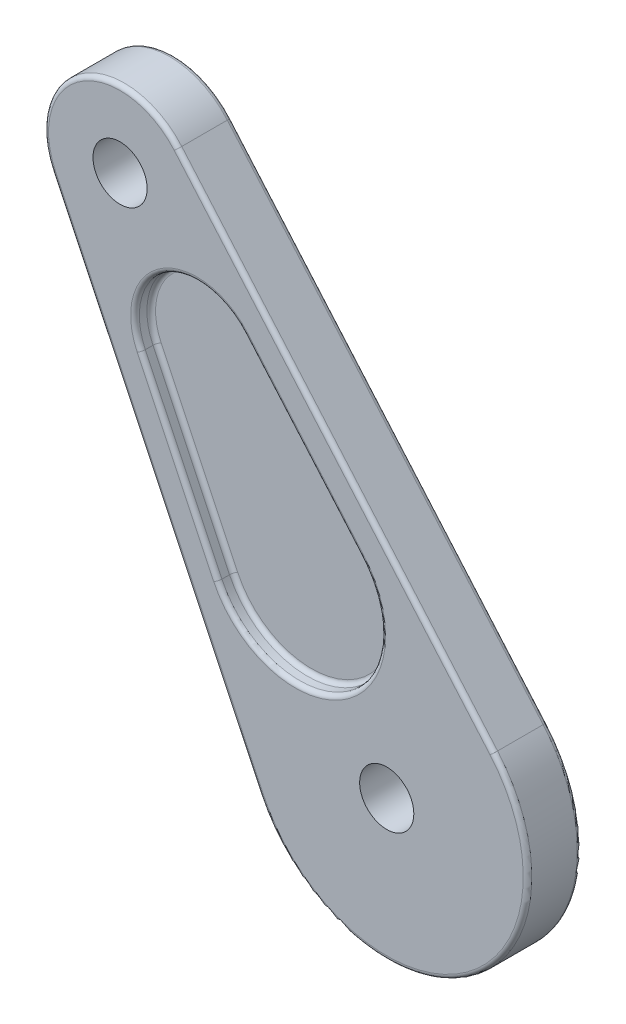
from build123d import *

# Parameters (mm, degrees)
SKETCH1_R      = 12.5
EXTRUDE1_DEPTH = 12.5
FILLET1_R      = 2
EXTRUDE2_DEPTH = 7.5
FILLET2_R      = 2


with BuildPart() as part:
    # Sketch1 → Extrude1 (new, symmetric)
    with BuildSketch(Plane.XY):
        with BuildLine():
            Line((-96.601464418, 211.23010456), (49.184727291, 42.495442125))
            ThreePointArc((49.184727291, 42.495442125), (35.558047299, -54.411628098), (-58.666873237, -27.985674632))
            Line((-58.666873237, -27.985674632), (-154.675403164, 173.278733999))
            ThreePointArc((-154.675403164, 173.278733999), (-142.232189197, 217.646512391), (-96.601464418, 211.23010456))
        make_face()
        Circle(SKETCH1_R, mode=Mode.SUBTRACT)
        with Locations((-123.085548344, 188.347943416)):
            Circle(SKETCH1_R, mode=Mode.SUBTRACT)
    extrude(amount=EXTRUDE1_DEPTH, both=True)

    # Fillet1
    fillet1_edges = [part.edges().sort_by_distance(p)[0] for p in [
        (35.558047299, -54.411628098, 12.5),
        (-23.708368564, 126.862773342, 12.5),
        (-142.232189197, 217.646512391, 12.5),
        (-23.708368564, 126.862773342, -12.5),
        (35.558047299, -54.411628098, -12.5),
        (-106.6711382, 72.646529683, -12.5),
        (-142.232189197, 217.646512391, -12.5),
        (-106.6711382, 72.646529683, 12.5),
    ]]
    fillet(fillet1_edges, radius=FILLET1_R)

    # Sketch2 → Extrude2 (cut)
    with BuildSketch(Plane.XY.offset(12.5)):
        with BuildLine():
            Line((-113.401096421, 121.593915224), (-78.072467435, 47.533874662))
            ThreePointArc((-78.072467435, 47.533874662), (-20.514258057, 31.391323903), (-12.190268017, 90.587950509))
            Line((-12.190268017, 90.587950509), (-65.835775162, 152.677894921))
            ThreePointArc((-65.835775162, 152.677894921), (-103.209511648, 157.933238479), (-113.401096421, 121.593915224))
        make_face()
    extrude2 = extrude(amount=-EXTRUDE2_DEPTH, mode=Mode.SUBTRACT)

    # Mirror1: Extrude2 across plane
    add(extrude2.mirror(Plane.XY), mode=Mode.SUBTRACT)

    # Fillet2
    fillet2_edges = [part.edges().sort_by_distance(p)[0] for p in [
        (-95.736781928, 84.563894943, 5),
        (-103.209511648, 157.933238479, 12.5),
        (-39.01302159, 121.632922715, 5),
        (-20.514258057, 31.391323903, 5),
        (-103.209511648, 157.933238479, 5),
        (-95.736781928, 84.563894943, 12.5),
        (-20.514258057, 31.391323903, 12.5),
        (-39.01302159, 121.632922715, 12.5),
        (-95.736781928, 84.563894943, -12.5),
        (-20.514258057, 31.391323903, -12.5),
        (-39.01302159, 121.632922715, -12.5),
        (-103.209511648, 157.933238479, -5),
        (-95.736781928, 84.563894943, -5),
        (-20.514258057, 31.391323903, -5),
        (-39.01302159, 121.632922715, -5),
        (-103.209511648, 157.933238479, -12.5),
    ]]
    fillet(fillet2_edges, radius=FILLET2_R)


solid = part.part
